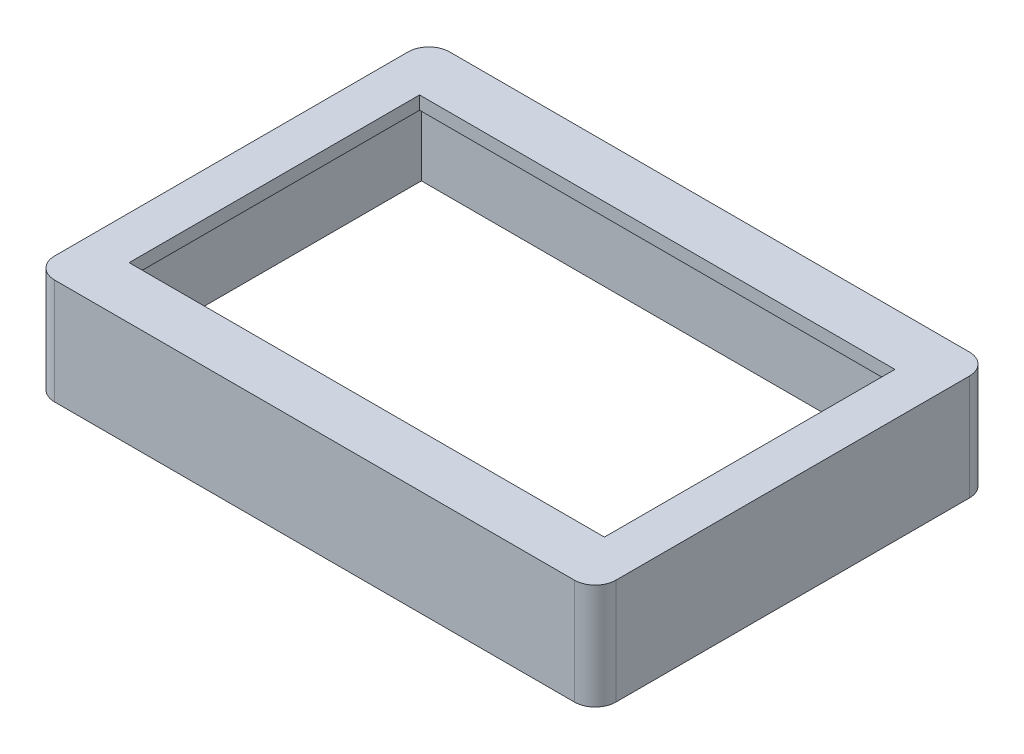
ISO-10303-21;
HEADER;
FILE_DESCRIPTION(('STEP AP214'),'2;1');
FILE_NAME('part.step','',(''),(''),'','','');
FILE_SCHEMA(('AUTOMOTIVE_DESIGN { 1 0 10303 214 1 1 1 1 }'));
ENDSEC;
DATA;
#1=APPLICATION_CONTEXT('core data for automotive mechanical design processes');
#2=APPLICATION_PROTOCOL_DEFINITION('international standard','automotive_design',2000,#1);
#3=PRODUCT_CONTEXT('',#1,'mechanical');
#4=PRODUCT('Part','Part','',(#3));
#5=PRODUCT_RELATED_PRODUCT_CATEGORY('part','',(#4));
#6=PRODUCT_DEFINITION_FORMATION('','',#4);
#7=PRODUCT_DEFINITION_CONTEXT('part definition',#1,'design');
#8=PRODUCT_DEFINITION('design','',#6,#7);
#9=PRODUCT_DEFINITION_SHAPE('','',#8);
#10=(LENGTH_UNIT() NAMED_UNIT(*) SI_UNIT(.MILLI.,.METRE.));
#11=(NAMED_UNIT(*) PLANE_ANGLE_UNIT() SI_UNIT($,.RADIAN.));
#12=(NAMED_UNIT(*) SI_UNIT($,.STERADIAN.) SOLID_ANGLE_UNIT());
#13=UNCERTAINTY_MEASURE_WITH_UNIT(LENGTH_MEASURE(1.E-05),#10,'distance_accuracy_value','');
#14=(GEOMETRIC_REPRESENTATION_CONTEXT(3) GLOBAL_UNCERTAINTY_ASSIGNED_CONTEXT((#13)) GLOBAL_UNIT_ASSIGNED_CONTEXT((#10,
#11,#12)) REPRESENTATION_CONTEXT('',''));
#15=CARTESIAN_POINT('',(0.,0.,0.));
#16=DIRECTION('',(0.,0.,1.));
#17=DIRECTION('',(1.,0.,0.));
#18=AXIS2_PLACEMENT_3D('',#15,#16,#17);
#19=CARTESIAN_POINT('',(124.65,25.4,-82.425));
#20=DIRECTION('',(1.,0.,0.));
#21=DIRECTION('',(0.,0.,-1.));
#22=AXIS2_PLACEMENT_3D('',#19,#20,#21);
#23=PLANE('',#22);
#24=DIRECTION('',(0.,0.,-1.));
#25=VECTOR('',#24,1.);
#26=CARTESIAN_POINT('',(124.65,22.225,-82.425));
#27=LINE('',#26,#25);
#28=CARTESIAN_POINT('',(124.65,22.225,-12.575));
#29=VERTEX_POINT('',#28);
#30=CARTESIAN_POINT('',(124.65,22.225,-82.425));
#31=VERTEX_POINT('',#30);
#32=EDGE_CURVE('E214',#29,#31,#27,.T.);
#33=ORIENTED_EDGE('',*,*,#32,.F.);
#34=DIRECTION('',(0.,-1.,0.));
#35=VECTOR('',#34,1.);
#36=CARTESIAN_POINT('',(124.65,25.4,-12.575));
#37=LINE('',#36,#35);
#38=CARTESIAN_POINT('',(124.65,25.4,-12.575));
#39=VERTEX_POINT('',#38);
#40=EDGE_CURVE('E233',#39,#29,#37,.T.);
#41=ORIENTED_EDGE('',*,*,#40,.F.);
#42=DIRECTION('',(0.,0.,1.));
#43=VECTOR('',#42,1.);
#44=CARTESIAN_POINT('',(124.65,25.4,-82.425));
#45=LINE('',#44,#43);
#46=CARTESIAN_POINT('',(124.65,25.4,-82.425));
#47=VERTEX_POINT('',#46);
#48=EDGE_CURVE('E217',#47,#39,#45,.T.);
#49=ORIENTED_EDGE('',*,*,#48,.F.);
#50=DIRECTION('',(0.,-1.,0.));
#51=VECTOR('',#50,1.);
#52=CARTESIAN_POINT('',(124.65,25.4,-82.425));
#53=LINE('',#52,#51);
#54=EDGE_CURVE('E234',#47,#31,#53,.T.);
#55=ORIENTED_EDGE('',*,*,#54,.T.);
#56=EDGE_LOOP('',(#33,#41,#49,#55));
#57=FACE_BOUND('',#56,.T.);
#58=ADVANCED_FACE('F39',(#57),#23,.F.);
#59=CARTESIAN_POINT('',(124.65,25.4,-82.425));
#60=DIRECTION('',(0.,0.,-1.));
#61=DIRECTION('',(-1.,0.,0.));
#62=AXIS2_PLACEMENT_3D('',#59,#60,#61);
#63=PLANE('',#62);
#64=DIRECTION('',(-1.,0.,0.));
#65=VECTOR('',#64,1.);
#66=CARTESIAN_POINT('',(124.65,22.225,-82.425));
#67=LINE('',#66,#65);
#68=CARTESIAN_POINT('',(10.35,22.225,-82.425));
#69=VERTEX_POINT('',#68);
#70=EDGE_CURVE('E211',#31,#69,#67,.T.);
#71=ORIENTED_EDGE('',*,*,#70,.F.);
#72=ORIENTED_EDGE('',*,*,#54,.F.);
#73=DIRECTION('',(1.,0.,0.));
#74=VECTOR('',#73,1.);
#75=CARTESIAN_POINT('',(124.65,25.4,-82.425));
#76=LINE('',#75,#74);
#77=CARTESIAN_POINT('',(10.35,25.4,-82.425));
#78=VERTEX_POINT('',#77);
#79=EDGE_CURVE('E229',#78,#47,#76,.T.);
#80=ORIENTED_EDGE('',*,*,#79,.F.);
#81=DIRECTION('',(0.,-1.,0.));
#82=VECTOR('',#81,1.);
#83=CARTESIAN_POINT('',(10.35,25.4,-82.425));
#84=LINE('',#83,#82);
#85=EDGE_CURVE('E239',#78,#69,#84,.T.);
#86=ORIENTED_EDGE('',*,*,#85,.T.);
#87=EDGE_LOOP('',(#71,#72,#80,#86));
#88=FACE_BOUND('',#87,.T.);
#89=ADVANCED_FACE('F365',(#88),#63,.F.);
#90=CARTESIAN_POINT('',(10.35,25.4,-82.425));
#91=DIRECTION('',(-1.,0.,0.));
#92=DIRECTION('',(0.,0.,1.));
#93=AXIS2_PLACEMENT_3D('',#90,#91,#92);
#94=PLANE('',#93);
#95=DIRECTION('',(0.,0.,1.));
#96=VECTOR('',#95,1.);
#97=CARTESIAN_POINT('',(10.35,22.225,-82.425));
#98=LINE('',#97,#96);
#99=CARTESIAN_POINT('',(10.35,22.225,-12.575));
#100=VERTEX_POINT('',#99);
#101=EDGE_CURVE('E203',#69,#100,#98,.T.);
#102=ORIENTED_EDGE('',*,*,#101,.F.);
#103=ORIENTED_EDGE('',*,*,#85,.F.);
#104=DIRECTION('',(0.,0.,-1.));
#105=VECTOR('',#104,1.);
#106=CARTESIAN_POINT('',(10.35,25.4,-82.425));
#107=LINE('',#106,#105);
#108=CARTESIAN_POINT('',(10.35,25.4,-12.575));
#109=VERTEX_POINT('',#108);
#110=EDGE_CURVE('E225',#109,#78,#107,.T.);
#111=ORIENTED_EDGE('',*,*,#110,.F.);
#112=DIRECTION('',(0.,-1.,0.));
#113=VECTOR('',#112,1.);
#114=CARTESIAN_POINT('',(10.35,25.4,-12.575));
#115=LINE('',#114,#113);
#116=EDGE_CURVE('E243',#109,#100,#115,.T.);
#117=ORIENTED_EDGE('',*,*,#116,.T.);
#118=EDGE_LOOP('',(#102,#103,#111,#117));
#119=FACE_BOUND('',#118,.T.);
#120=ADVANCED_FACE('F371',(#119),#94,.F.);
#121=CARTESIAN_POINT('',(124.65,25.4,-12.575));
#122=DIRECTION('',(0.,0.,1.));
#123=DIRECTION('',(1.,0.,0.));
#124=AXIS2_PLACEMENT_3D('',#121,#122,#123);
#125=PLANE('',#124);
#126=DIRECTION('',(1.,0.,0.));
#127=VECTOR('',#126,1.);
#128=CARTESIAN_POINT('',(124.65,22.225,-12.575));
#129=LINE('',#128,#127);
#130=EDGE_CURVE('E265',#100,#29,#129,.T.);
#131=ORIENTED_EDGE('',*,*,#130,.F.);
#132=ORIENTED_EDGE('',*,*,#116,.F.);
#133=DIRECTION('',(-1.,0.,0.));
#134=VECTOR('',#133,1.);
#135=CARTESIAN_POINT('',(124.65,25.4,-12.575));
#136=LINE('',#135,#134);
#137=EDGE_CURVE('E221',#39,#109,#136,.T.);
#138=ORIENTED_EDGE('',*,*,#137,.F.);
#139=ORIENTED_EDGE('',*,*,#40,.T.);
#140=EDGE_LOOP('',(#131,#132,#138,#139));
#141=FACE_BOUND('',#140,.T.);
#142=ADVANCED_FACE('F377',(#141),#125,.F.);
#143=CARTESIAN_POINT('',(0.,25.4,0.));
#144=DIRECTION('',(1.,0.,0.));
#145=DIRECTION('',(0.,0.,-1.));
#146=AXIS2_PLACEMENT_3D('',#143,#144,#145);
#147=PLANE('',#146);
#148=DIRECTION('',(0.,0.,1.));
#149=VECTOR('',#148,1.);
#150=CARTESIAN_POINT('',(0.,0.,0.));
#151=LINE('',#150,#149);
#152=CARTESIAN_POINT('',(0.,0.,-90.));
#153=VERTEX_POINT('',#152);
#154=CARTESIAN_POINT('',(0.,0.,-5.));
#155=VERTEX_POINT('',#154);
#156=EDGE_CURVE('E238',#153,#155,#151,.T.);
#157=ORIENTED_EDGE('',*,*,#156,.T.);
#158=DIRECTION('',(0.,-1.,0.));
#159=VECTOR('',#158,1.);
#160=CARTESIAN_POINT('',(0.,25.4,-5.));
#161=LINE('',#160,#159);
#162=CARTESIAN_POINT('',(0.,25.4,-5.));
#163=VERTEX_POINT('',#162);
#164=EDGE_CURVE('E322',#155,#163,#161,.F.);
#165=ORIENTED_EDGE('',*,*,#164,.T.);
#166=DIRECTION('',(0.,0.,1.));
#167=VECTOR('',#166,1.);
#168=CARTESIAN_POINT('',(0.,25.4,0.));
#169=LINE('',#168,#167);
#170=CARTESIAN_POINT('',(0.,25.4,-90.));
#171=VERTEX_POINT('',#170);
#172=EDGE_CURVE('E250',#171,#163,#169,.T.);
#173=ORIENTED_EDGE('',*,*,#172,.F.);
#174=DIRECTION('',(0.,-1.,0.));
#175=VECTOR('',#174,1.);
#176=CARTESIAN_POINT('',(0.,25.4,-90.));
#177=LINE('',#176,#175);
#178=EDGE_CURVE('E318',#171,#153,#177,.T.);
#179=ORIENTED_EDGE('',*,*,#178,.T.);
#180=EDGE_LOOP('',(#157,#165,#173,#179));
#181=FACE_BOUND('',#180,.T.);
#182=ADVANCED_FACE('F340',(#181),#147,.F.);
#183=CARTESIAN_POINT('',(0.,25.4,0.));
#184=DIRECTION('',(0.,0.,-1.));
#185=DIRECTION('',(-1.,0.,0.));
#186=AXIS2_PLACEMENT_3D('',#183,#184,#185);
#187=PLANE('',#186);
#188=DIRECTION('',(1.,0.,0.));
#189=VECTOR('',#188,1.);
#190=CARTESIAN_POINT('',(0.,0.,0.));
#191=LINE('',#190,#189);
#192=CARTESIAN_POINT('',(5.,0.,0.));
#193=VERTEX_POINT('',#192);
#194=CARTESIAN_POINT('',(130.,0.,0.));
#195=VERTEX_POINT('',#194);
#196=EDGE_CURVE('E269',#193,#195,#191,.T.);
#197=ORIENTED_EDGE('',*,*,#196,.T.);
#198=DIRECTION('',(0.,-1.,0.));
#199=VECTOR('',#198,1.);
#200=CARTESIAN_POINT('',(130.,25.4,0.));
#201=LINE('',#200,#199);
#202=CARTESIAN_POINT('',(130.,25.4,0.));
#203=VERTEX_POINT('',#202);
#204=EDGE_CURVE('E304',#195,#203,#201,.F.);
#205=ORIENTED_EDGE('',*,*,#204,.T.);
#206=DIRECTION('',(1.,0.,0.));
#207=VECTOR('',#206,1.);
#208=CARTESIAN_POINT('',(0.,25.4,0.));
#209=LINE('',#208,#207);
#210=CARTESIAN_POINT('',(5.,25.4,0.));
#211=VERTEX_POINT('',#210);
#212=EDGE_CURVE('E254',#211,#203,#209,.T.);
#213=ORIENTED_EDGE('',*,*,#212,.F.);
#214=DIRECTION('',(0.,-1.,0.));
#215=VECTOR('',#214,1.);
#216=CARTESIAN_POINT('',(5.,25.4,0.));
#217=LINE('',#216,#215);
#218=EDGE_CURVE('E300',#211,#193,#217,.T.);
#219=ORIENTED_EDGE('',*,*,#218,.T.);
#220=EDGE_LOOP('',(#197,#205,#213,#219));
#221=FACE_BOUND('',#220,.T.);
#222=ADVANCED_FACE('F350',(#221),#187,.F.);
#223=CARTESIAN_POINT('',(135.,25.4,0.));
#224=DIRECTION('',(-1.,0.,0.));
#225=DIRECTION('',(0.,0.,1.));
#226=AXIS2_PLACEMENT_3D('',#223,#224,#225);
#227=PLANE('',#226);
#228=DIRECTION('',(0.,0.,-1.));
#229=VECTOR('',#228,1.);
#230=CARTESIAN_POINT('',(135.,25.4,0.));
#231=LINE('',#230,#229);
#232=CARTESIAN_POINT('',(135.,25.4,-5.));
#233=VERTEX_POINT('',#232);
#234=CARTESIAN_POINT('',(135.,25.4,-90.));
#235=VERTEX_POINT('',#234);
#236=EDGE_CURVE('E259',#233,#235,#231,.T.);
#237=ORIENTED_EDGE('',*,*,#236,.F.);
#238=DIRECTION('',(0.,-1.,0.));
#239=VECTOR('',#238,1.);
#240=CARTESIAN_POINT('',(135.,25.4,-5.));
#241=LINE('',#240,#239);
#242=CARTESIAN_POINT('',(135.,0.,-5.));
#243=VERTEX_POINT('',#242);
#244=EDGE_CURVE('E284',#233,#243,#241,.T.);
#245=ORIENTED_EDGE('',*,*,#244,.T.);
#246=DIRECTION('',(0.,0.,-1.));
#247=VECTOR('',#246,1.);
#248=CARTESIAN_POINT('',(135.,0.,0.));
#249=LINE('',#248,#247);
#250=CARTESIAN_POINT('',(135.,0.,-90.));
#251=VERTEX_POINT('',#250);
#252=EDGE_CURVE('E273',#243,#251,#249,.T.);
#253=ORIENTED_EDGE('',*,*,#252,.T.);
#254=DIRECTION('',(0.,-1.,0.));
#255=VECTOR('',#254,1.);
#256=CARTESIAN_POINT('',(135.,25.4,-90.));
#257=LINE('',#256,#255);
#258=EDGE_CURVE('E281',#251,#235,#257,.F.);
#259=ORIENTED_EDGE('',*,*,#258,.T.);
#260=EDGE_LOOP('',(#237,#245,#253,#259));
#261=FACE_BOUND('',#260,.T.);
#262=ADVANCED_FACE('F358',(#261),#227,.F.);
#263=CARTESIAN_POINT('',(0.,25.4,-95.));
#264=DIRECTION('',(0.,0.,1.));
#265=DIRECTION('',(1.,0.,0.));
#266=AXIS2_PLACEMENT_3D('',#263,#264,#265);
#267=PLANE('',#266);
#268=DIRECTION('',(-1.,0.,0.));
#269=VECTOR('',#268,1.);
#270=CARTESIAN_POINT('',(0.,0.,-95.));
#271=LINE('',#270,#269);
#272=CARTESIAN_POINT('',(130.,0.,-95.));
#273=VERTEX_POINT('',#272);
#274=CARTESIAN_POINT('',(4.99999999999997,0.,-95.));
#275=VERTEX_POINT('',#274);
#276=EDGE_CURVE('E255',#273,#275,#271,.T.);
#277=ORIENTED_EDGE('',*,*,#276,.T.);
#278=DIRECTION('',(0.,-1.,0.));
#279=VECTOR('',#278,1.);
#280=CARTESIAN_POINT('',(4.99999999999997,25.4,-95.));
#281=LINE('',#280,#279);
#282=CARTESIAN_POINT('',(4.99999999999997,25.4,-95.));
#283=VERTEX_POINT('',#282);
#284=EDGE_CURVE('E11',#275,#283,#281,.F.);
#285=ORIENTED_EDGE('',*,*,#284,.T.);
#286=DIRECTION('',(-1.,0.,0.));
#287=VECTOR('',#286,1.);
#288=CARTESIAN_POINT('',(0.,25.4,-95.));
#289=LINE('',#288,#287);
#290=CARTESIAN_POINT('',(130.,25.4,-95.));
#291=VERTEX_POINT('',#290);
#292=EDGE_CURVE('E262',#291,#283,#289,.T.);
#293=ORIENTED_EDGE('',*,*,#292,.F.);
#294=DIRECTION('',(0.,-1.,0.));
#295=VECTOR('',#294,1.);
#296=CARTESIAN_POINT('',(130.,25.4,-95.));
#297=LINE('',#296,#295);
#298=EDGE_CURVE('E48',#291,#273,#297,.T.);
#299=ORIENTED_EDGE('',*,*,#298,.T.);
#300=EDGE_LOOP('',(#277,#285,#293,#299));
#301=FACE_BOUND('',#300,.T.);
#302=ADVANCED_FACE('F328',(#301),#267,.F.);
#303=CARTESIAN_POINT('',(0.,25.4,0.));
#304=DIRECTION('',(0.,-1.,0.));
#305=DIRECTION('',(0.,0.,-1.));
#306=AXIS2_PLACEMENT_3D('',#303,#304,#305);
#307=PLANE('',#306);
#308=ORIENTED_EDGE('',*,*,#79,.T.);
#309=ORIENTED_EDGE('',*,*,#48,.T.);
#310=ORIENTED_EDGE('',*,*,#137,.T.);
#311=ORIENTED_EDGE('',*,*,#110,.T.);
#312=EDGE_LOOP('',(#308,#309,#310,#311));
#313=FACE_BOUND('',#312,.T.);
#314=ORIENTED_EDGE('',*,*,#212,.T.);
#315=CARTESIAN_POINT('',(130.,25.4,-5.));
#316=DIRECTION('',(0.,-1.,0.));
#317=DIRECTION('',(0.,0.,-1.));
#318=AXIS2_PLACEMENT_3D('',#315,#316,#317);
#319=CIRCLE('',#318,5.);
#320=EDGE_CURVE('E315',#203,#233,#319,.F.);
#321=ORIENTED_EDGE('',*,*,#320,.T.);
#322=ORIENTED_EDGE('',*,*,#236,.T.);
#323=CARTESIAN_POINT('',(130.,25.4,-90.));
#324=DIRECTION('',(0.,-1.,0.));
#325=DIRECTION('',(0.,0.,-1.));
#326=AXIS2_PLACEMENT_3D('',#323,#324,#325);
#327=CIRCLE('',#326,5.);
#328=EDGE_CURVE('E60',#235,#291,#327,.F.);
#329=ORIENTED_EDGE('',*,*,#328,.T.);
#330=ORIENTED_EDGE('',*,*,#292,.T.);
#331=CARTESIAN_POINT('',(4.99999999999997,25.4,-90.));
#332=DIRECTION('',(0.,-1.,0.));
#333=DIRECTION('',(0.,0.,-1.));
#334=AXIS2_PLACEMENT_3D('',#331,#332,#333);
#335=CIRCLE('',#334,5.);
#336=EDGE_CURVE('E309',#283,#171,#335,.F.);
#337=ORIENTED_EDGE('',*,*,#336,.T.);
#338=ORIENTED_EDGE('',*,*,#172,.T.);
#339=CARTESIAN_POINT('',(5.,25.4,-5.));
#340=DIRECTION('',(0.,-1.,0.));
#341=DIRECTION('',(0.,0.,-1.));
#342=AXIS2_PLACEMENT_3D('',#339,#340,#341);
#343=CIRCLE('',#342,5.);
#344=EDGE_CURVE('E312',#163,#211,#343,.F.);
#345=ORIENTED_EDGE('',*,*,#344,.T.);
#346=EDGE_LOOP('',(#314,#321,#322,#329,#330,#337,#338,#345));
#347=FACE_BOUND('',#346,.T.);
#348=ADVANCED_FACE('F343',(#313,#347),#307,.F.);
#349=CARTESIAN_POINT('',(0.,0.,0.));
#350=DIRECTION('',(0.,-1.,0.));
#351=DIRECTION('',(0.,0.,-1.));
#352=AXIS2_PLACEMENT_3D('',#349,#350,#351);
#353=PLANE('',#352);
#354=DIRECTION('',(0.,0.,1.));
#355=VECTOR('',#354,1.);
#356=CARTESIAN_POINT('',(131.5,0.,-90.1466666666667));
#357=LINE('',#356,#355);
#358=CARTESIAN_POINT('',(131.5,0.,-90.1466666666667));
#359=VERTEX_POINT('',#358);
#360=CARTESIAN_POINT('',(131.5,0.,-4.74666666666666));
#361=VERTEX_POINT('',#360);
#362=EDGE_CURVE('E160',#359,#361,#357,.T.);
#363=ORIENTED_EDGE('',*,*,#362,.F.);
#364=DIRECTION('',(1.,0.,0.));
#365=VECTOR('',#364,1.);
#366=CARTESIAN_POINT('',(131.5,0.,-90.1466666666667));
#367=LINE('',#366,#365);
#368=CARTESIAN_POINT('',(3.06377578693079,0.,-90.1466666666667));
#369=VERTEX_POINT('',#368);
#370=EDGE_CURVE('E181',#369,#359,#367,.T.);
#371=ORIENTED_EDGE('',*,*,#370,.F.);
#372=DIRECTION('',(0.,0.,-1.));
#373=VECTOR('',#372,1.);
#374=CARTESIAN_POINT('',(3.06377578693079,0.,-90.1466666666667));
#375=LINE('',#374,#373);
#376=CARTESIAN_POINT('',(3.06377578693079,0.,-4.74666666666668));
#377=VERTEX_POINT('',#376);
#378=EDGE_CURVE('E185',#377,#369,#375,.T.);
#379=ORIENTED_EDGE('',*,*,#378,.F.);
#380=DIRECTION('',(-1.,0.,0.));
#381=VECTOR('',#380,1.);
#382=CARTESIAN_POINT('',(131.5,0.,-4.74666666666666));
#383=LINE('',#382,#381);
#384=EDGE_CURVE('E194',#361,#377,#383,.T.);
#385=ORIENTED_EDGE('',*,*,#384,.F.);
#386=EDGE_LOOP('',(#363,#371,#379,#385));
#387=FACE_BOUND('',#386,.T.);
#388=ORIENTED_EDGE('',*,*,#252,.F.);
#389=CARTESIAN_POINT('',(130.,0.,-5.));
#390=DIRECTION('',(0.,-1.,0.));
#391=DIRECTION('',(0.,0.,-1.));
#392=AXIS2_PLACEMENT_3D('',#389,#390,#391);
#393=CIRCLE('',#392,5.);
#394=EDGE_CURVE('E297',#243,#195,#393,.T.);
#395=ORIENTED_EDGE('',*,*,#394,.T.);
#396=ORIENTED_EDGE('',*,*,#196,.F.);
#397=CARTESIAN_POINT('',(5.,0.,-5.));
#398=DIRECTION('',(0.,-1.,0.));
#399=DIRECTION('',(0.,0.,-1.));
#400=AXIS2_PLACEMENT_3D('',#397,#398,#399);
#401=CIRCLE('',#400,5.);
#402=EDGE_CURVE('E294',#193,#155,#401,.T.);
#403=ORIENTED_EDGE('',*,*,#402,.T.);
#404=ORIENTED_EDGE('',*,*,#156,.F.);
#405=CARTESIAN_POINT('',(4.99999999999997,0.,-90.));
#406=DIRECTION('',(0.,-1.,0.));
#407=DIRECTION('',(0.,0.,-1.));
#408=AXIS2_PLACEMENT_3D('',#405,#406,#407);
#409=CIRCLE('',#408,5.);
#410=EDGE_CURVE('E291',#153,#275,#409,.T.);
#411=ORIENTED_EDGE('',*,*,#410,.T.);
#412=ORIENTED_EDGE('',*,*,#276,.F.);
#413=CARTESIAN_POINT('',(130.,0.,-90.));
#414=DIRECTION('',(0.,-1.,0.));
#415=DIRECTION('',(0.,0.,-1.));
#416=AXIS2_PLACEMENT_3D('',#413,#414,#415);
#417=CIRCLE('',#416,5.);
#418=EDGE_CURVE('E288',#273,#251,#417,.T.);
#419=ORIENTED_EDGE('',*,*,#418,.T.);
#420=EDGE_LOOP('',(#388,#395,#396,#403,#404,#411,#412,#419));
#421=FACE_BOUND('',#420,.T.);
#422=ADVANCED_FACE('F332',(#387,#421),#353,.T.);
#423=CARTESIAN_POINT('',(0.,22.225,0.));
#424=DIRECTION('',(0.,-1.,0.));
#425=DIRECTION('',(0.,0.,-1.));
#426=AXIS2_PLACEMENT_3D('',#423,#424,#425);
#427=PLANE('',#426);
#428=DIRECTION('',(0.,0.,1.));
#429=VECTOR('',#428,1.);
#430=CARTESIAN_POINT('',(131.5,22.225,-90.1466666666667));
#431=LINE('',#430,#429);
#432=CARTESIAN_POINT('',(131.5,22.225,-90.1466666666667));
#433=VERTEX_POINT('',#432);
#434=CARTESIAN_POINT('',(131.5,22.225,-4.74666666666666));
#435=VERTEX_POINT('',#434);
#436=EDGE_CURVE('E157',#433,#435,#431,.T.);
#437=ORIENTED_EDGE('',*,*,#436,.T.);
#438=DIRECTION('',(-1.,0.,0.));
#439=VECTOR('',#438,1.);
#440=CARTESIAN_POINT('',(131.5,22.225,-4.74666666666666));
#441=LINE('',#440,#439);
#442=CARTESIAN_POINT('',(3.06377578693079,22.225,-4.74666666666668));
#443=VERTEX_POINT('',#442);
#444=EDGE_CURVE('E169',#435,#443,#441,.T.);
#445=ORIENTED_EDGE('',*,*,#444,.T.);
#446=DIRECTION('',(0.,0.,-1.));
#447=VECTOR('',#446,1.);
#448=CARTESIAN_POINT('',(3.06377578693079,22.225,-90.1466666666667));
#449=LINE('',#448,#447);
#450=CARTESIAN_POINT('',(3.06377578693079,22.225,-90.1466666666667));
#451=VERTEX_POINT('',#450);
#452=EDGE_CURVE('E175',#443,#451,#449,.T.);
#453=ORIENTED_EDGE('',*,*,#452,.T.);
#454=DIRECTION('',(1.,0.,0.));
#455=VECTOR('',#454,1.);
#456=CARTESIAN_POINT('',(131.5,22.225,-90.1466666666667));
#457=LINE('',#456,#455);
#458=EDGE_CURVE('E166',#451,#433,#457,.T.);
#459=ORIENTED_EDGE('',*,*,#458,.T.);
#460=EDGE_LOOP('',(#437,#445,#453,#459));
#461=FACE_BOUND('',#460,.T.);
#462=ORIENTED_EDGE('',*,*,#32,.T.);
#463=ORIENTED_EDGE('',*,*,#70,.T.);
#464=ORIENTED_EDGE('',*,*,#101,.T.);
#465=ORIENTED_EDGE('',*,*,#130,.T.);
#466=EDGE_LOOP('',(#462,#463,#464,#465));
#467=FACE_BOUND('',#466,.T.);
#468=ADVANCED_FACE('F177',(#461,#467),#427,.T.);
#469=CARTESIAN_POINT('',(131.5,22.225,-90.1466666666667));
#470=DIRECTION('',(1.,0.,0.));
#471=DIRECTION('',(0.,0.,-1.));
#472=AXIS2_PLACEMENT_3D('',#469,#470,#471);
#473=PLANE('',#472);
#474=ORIENTED_EDGE('',*,*,#362,.T.);
#475=DIRECTION('',(0.,-1.,0.));
#476=VECTOR('',#475,1.);
#477=CARTESIAN_POINT('',(131.5,22.225,-4.74666666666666));
#478=LINE('',#477,#476);
#479=EDGE_CURVE('E153',#435,#361,#478,.T.);
#480=ORIENTED_EDGE('',*,*,#479,.F.);
#481=ORIENTED_EDGE('',*,*,#436,.F.);
#482=DIRECTION('',(0.,-1.,0.));
#483=VECTOR('',#482,1.);
#484=CARTESIAN_POINT('',(131.5,22.225,-90.1466666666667));
#485=LINE('',#484,#483);
#486=EDGE_CURVE('E200',#433,#359,#485,.T.);
#487=ORIENTED_EDGE('',*,*,#486,.T.);
#488=EDGE_LOOP('',(#474,#480,#481,#487));
#489=FACE_BOUND('',#488,.T.);
#490=ADVANCED_FACE('F155',(#489),#473,.F.);
#491=CARTESIAN_POINT('',(131.5,22.225,-90.1466666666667));
#492=DIRECTION('',(0.,0.,-1.));
#493=DIRECTION('',(-1.,0.,0.));
#494=AXIS2_PLACEMENT_3D('',#491,#492,#493);
#495=PLANE('',#494);
#496=ORIENTED_EDGE('',*,*,#370,.T.);
#497=ORIENTED_EDGE('',*,*,#486,.F.);
#498=ORIENTED_EDGE('',*,*,#458,.F.);
#499=DIRECTION('',(0.,-1.,0.));
#500=VECTOR('',#499,1.);
#501=CARTESIAN_POINT('',(3.06377578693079,22.225,-90.1466666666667));
#502=LINE('',#501,#500);
#503=EDGE_CURVE('E204',#451,#369,#502,.T.);
#504=ORIENTED_EDGE('',*,*,#503,.T.);
#505=EDGE_LOOP('',(#496,#497,#498,#504));
#506=FACE_BOUND('',#505,.T.);
#507=ADVANCED_FACE('F434',(#506),#495,.F.);
#508=CARTESIAN_POINT('',(3.06377578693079,22.225,-90.1466666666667));
#509=DIRECTION('',(-1.,0.,0.));
#510=DIRECTION('',(0.,0.,1.));
#511=AXIS2_PLACEMENT_3D('',#508,#509,#510);
#512=PLANE('',#511);
#513=ORIENTED_EDGE('',*,*,#378,.T.);
#514=ORIENTED_EDGE('',*,*,#503,.F.);
#515=ORIENTED_EDGE('',*,*,#452,.F.);
#516=DIRECTION('',(0.,-1.,0.));
#517=VECTOR('',#516,1.);
#518=CARTESIAN_POINT('',(3.06377578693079,22.225,-4.74666666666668));
#519=LINE('',#518,#517);
#520=EDGE_CURVE('E165',#443,#377,#519,.T.);
#521=ORIENTED_EDGE('',*,*,#520,.T.);
#522=EDGE_LOOP('',(#513,#514,#515,#521));
#523=FACE_BOUND('',#522,.T.);
#524=ADVANCED_FACE('F425',(#523),#512,.F.);
#525=CARTESIAN_POINT('',(131.5,22.225,-4.74666666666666));
#526=DIRECTION('',(0.,0.,1.));
#527=DIRECTION('',(1.,0.,0.));
#528=AXIS2_PLACEMENT_3D('',#525,#526,#527);
#529=PLANE('',#528);
#530=ORIENTED_EDGE('',*,*,#384,.T.);
#531=ORIENTED_EDGE('',*,*,#520,.F.);
#532=ORIENTED_EDGE('',*,*,#444,.F.);
#533=ORIENTED_EDGE('',*,*,#479,.T.);
#534=EDGE_LOOP('',(#530,#531,#532,#533));
#535=FACE_BOUND('',#534,.T.);
#536=ADVANCED_FACE('F170',(#535),#529,.F.);
#537=CARTESIAN_POINT('',(130.,25.4,-5.));
#538=DIRECTION('',(0.,-1.,0.));
#539=DIRECTION('',(0.,0.,-1.));
#540=AXIS2_PLACEMENT_3D('',#537,#538,#539);
#541=CYLINDRICAL_SURFACE('',#540,5.);
#542=ORIENTED_EDGE('',*,*,#320,.F.);
#543=ORIENTED_EDGE('',*,*,#204,.F.);
#544=ORIENTED_EDGE('',*,*,#394,.F.);
#545=ORIENTED_EDGE('',*,*,#244,.F.);
#546=EDGE_LOOP('',(#542,#543,#544,#545));
#547=FACE_BOUND('',#546,.T.);
#548=ADVANCED_FACE('F355',(#547),#541,.T.);
#549=CARTESIAN_POINT('',(5.,25.4,-5.));
#550=DIRECTION('',(0.,-1.,0.));
#551=DIRECTION('',(0.,0.,-1.));
#552=AXIS2_PLACEMENT_3D('',#549,#550,#551);
#553=CYLINDRICAL_SURFACE('',#552,5.);
#554=ORIENTED_EDGE('',*,*,#344,.F.);
#555=ORIENTED_EDGE('',*,*,#164,.F.);
#556=ORIENTED_EDGE('',*,*,#402,.F.);
#557=ORIENTED_EDGE('',*,*,#218,.F.);
#558=EDGE_LOOP('',(#554,#555,#556,#557));
#559=FACE_BOUND('',#558,.T.);
#560=ADVANCED_FACE('F347',(#559),#553,.T.);
#561=CARTESIAN_POINT('',(4.99999999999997,25.4,-90.));
#562=DIRECTION('',(0.,-1.,0.));
#563=DIRECTION('',(0.,0.,-1.));
#564=AXIS2_PLACEMENT_3D('',#561,#562,#563);
#565=CYLINDRICAL_SURFACE('',#564,5.);
#566=ORIENTED_EDGE('',*,*,#336,.F.);
#567=ORIENTED_EDGE('',*,*,#284,.F.);
#568=ORIENTED_EDGE('',*,*,#410,.F.);
#569=ORIENTED_EDGE('',*,*,#178,.F.);
#570=EDGE_LOOP('',(#566,#567,#568,#569));
#571=FACE_BOUND('',#570,.T.);
#572=ADVANCED_FACE('F337',(#571),#565,.T.);
#573=CARTESIAN_POINT('',(130.,25.4,-90.));
#574=DIRECTION('',(0.,-1.,0.));
#575=DIRECTION('',(0.,0.,-1.));
#576=AXIS2_PLACEMENT_3D('',#573,#574,#575);
#577=CYLINDRICAL_SURFACE('',#576,5.);
#578=ORIENTED_EDGE('',*,*,#328,.F.);
#579=ORIENTED_EDGE('',*,*,#258,.F.);
#580=ORIENTED_EDGE('',*,*,#418,.F.);
#581=ORIENTED_EDGE('',*,*,#298,.F.);
#582=EDGE_LOOP('',(#578,#579,#580,#581));
#583=FACE_BOUND('',#582,.T.);
#584=ADVANCED_FACE('F41',(#583),#577,.T.);
#585=CLOSED_SHELL('',(#58,#89,#120,#142,#182,#222,#262,#302,#348,#422,#468,#490,#507,#524,#536,
#548,#560,#572,#584));
#586=MANIFOLD_SOLID_BREP('B2',#585);
#587=ADVANCED_BREP_SHAPE_REPRESENTATION('',(#18,#586),#14);
#588=SHAPE_DEFINITION_REPRESENTATION(#9,#587);
ENDSEC;
END-ISO-10303-21;
